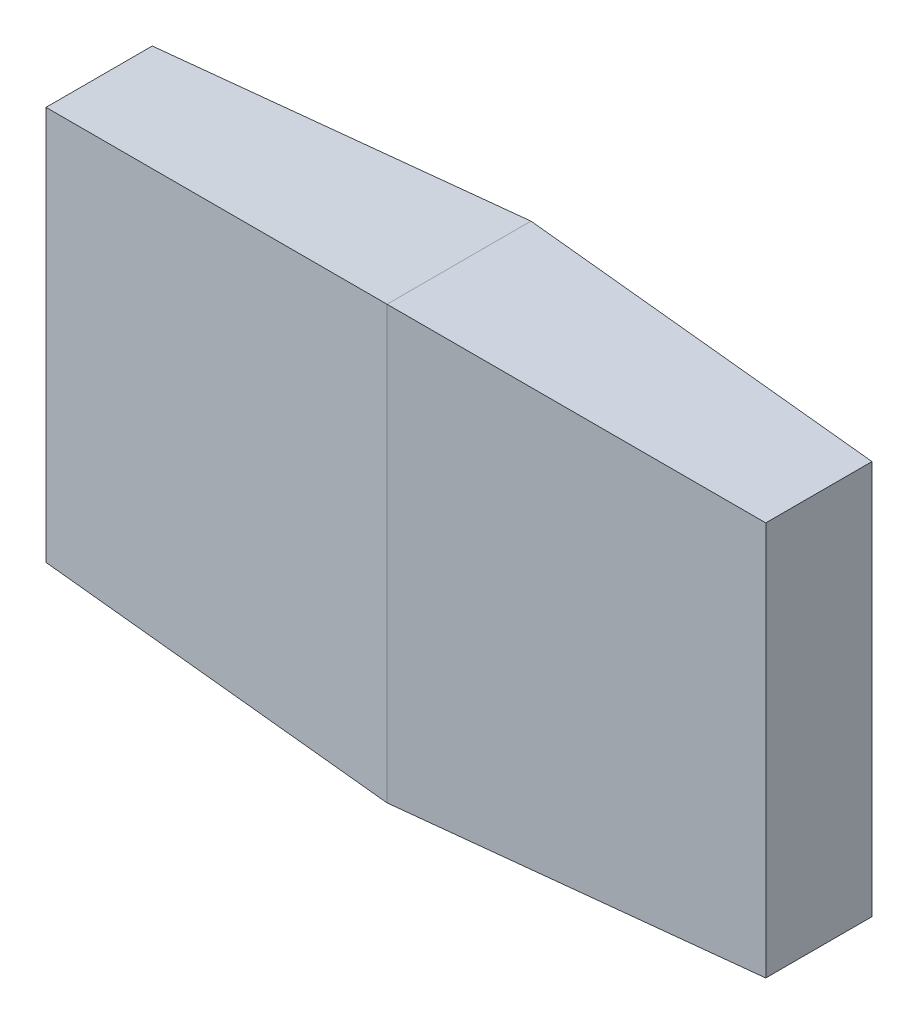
ISO-10303-21;
HEADER;
FILE_DESCRIPTION(('STEP AP214'),'2;1');
FILE_NAME('part.step','',(''),(''),'','','');
FILE_SCHEMA(('AUTOMOTIVE_DESIGN { 1 0 10303 214 1 1 1 1 }'));
ENDSEC;
DATA;
#1=APPLICATION_CONTEXT('core data for automotive mechanical design processes');
#2=APPLICATION_PROTOCOL_DEFINITION('international standard','automotive_design',2000,#1);
#3=PRODUCT_CONTEXT('',#1,'mechanical');
#4=PRODUCT('Part','Part','',(#3));
#5=PRODUCT_RELATED_PRODUCT_CATEGORY('part','',(#4));
#6=PRODUCT_DEFINITION_FORMATION('','',#4);
#7=PRODUCT_DEFINITION_CONTEXT('part definition',#1,'design');
#8=PRODUCT_DEFINITION('design','',#6,#7);
#9=PRODUCT_DEFINITION_SHAPE('','',#8);
#10=(LENGTH_UNIT() NAMED_UNIT(*) SI_UNIT(.MILLI.,.METRE.));
#11=(NAMED_UNIT(*) PLANE_ANGLE_UNIT() SI_UNIT($,.RADIAN.));
#12=(NAMED_UNIT(*) SI_UNIT($,.STERADIAN.) SOLID_ANGLE_UNIT());
#13=UNCERTAINTY_MEASURE_WITH_UNIT(LENGTH_MEASURE(1.E-05),#10,'distance_accuracy_value','');
#14=(GEOMETRIC_REPRESENTATION_CONTEXT(3) GLOBAL_UNCERTAINTY_ASSIGNED_CONTEXT((#13)) GLOBAL_UNIT_ASSIGNED_CONTEXT((#10,
#11,#12)) REPRESENTATION_CONTEXT('',''));
#15=CARTESIAN_POINT('',(0.,0.,0.));
#16=DIRECTION('',(0.,0.,1.));
#17=DIRECTION('',(1.,0.,0.));
#18=AXIS2_PLACEMENT_3D('',#15,#16,#17);
#19=CARTESIAN_POINT('',(0.,30.,0.));
#20=DIRECTION('',(-0.0523359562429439,0.998629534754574,0.));
#21=DIRECTION('',(-0.998629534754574,-0.0523359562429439,0.));
#22=AXIS2_PLACEMENT_3D('',#19,#20,#21);
#23=PLANE('',#22);
#24=DIRECTION('',(0.,0.,1.));
#25=VECTOR('',#24,1.);
#26=CARTESIAN_POINT('',(0.,30.,0.));
#27=LINE('',#26,#25);
#28=CARTESIAN_POINT('',(0.,30.,-10.));
#29=VERTEX_POINT('',#28);
#30=CARTESIAN_POINT('',(0.,30.,10.));
#31=VERTEX_POINT('',#30);
#32=EDGE_CURVE('E11',#29,#31,#27,.T.);
#33=ORIENTED_EDGE('',*,*,#32,.F.);
#34=DIRECTION('',(-0.997264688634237,-0.052264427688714,0.052264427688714));
#35=VECTOR('',#34,1.);
#36=CARTESIAN_POINT('',(-0.52121468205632,29.9726842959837,-9.97268429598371));
#37=LINE('',#36,#35);
#38=CARTESIAN_POINT('',(-50.,27.3796110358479,-7.37961103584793));
#39=VERTEX_POINT('',#38);
#40=EDGE_CURVE('E75',#29,#39,#37,.T.);
#41=ORIENTED_EDGE('',*,*,#40,.T.);
#42=DIRECTION('',(0.,0.,1.));
#43=VECTOR('',#42,1.);
#44=CARTESIAN_POINT('',(-50.,27.3796110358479,10.));
#45=LINE('',#44,#43);
#46=CARTESIAN_POINT('',(-50.,27.3796110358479,7.37961103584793));
#47=VERTEX_POINT('',#46);
#48=EDGE_CURVE('E111',#47,#39,#45,.F.);
#49=ORIENTED_EDGE('',*,*,#48,.F.);
#50=DIRECTION('',(0.997264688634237,0.052264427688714,0.052264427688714));
#51=VECTOR('',#50,1.);
#52=CARTESIAN_POINT('',(-0.52121468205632,29.9726842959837,9.97268429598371));
#53=LINE('',#52,#51);
#54=EDGE_CURVE('E102',#31,#47,#53,.F.);
#55=ORIENTED_EDGE('',*,*,#54,.F.);
#56=EDGE_LOOP('',(#33,#41,#49,#55));
#57=FACE_BOUND('',#56,.T.);
#58=ADVANCED_FACE('F35',(#57),#23,.T.);
#59=CARTESIAN_POINT('',(0.,0.,-10.));
#60=DIRECTION('',(-0.0523359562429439,0.,-0.998629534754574));
#61=DIRECTION('',(-0.998629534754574,0.,0.0523359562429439));
#62=AXIS2_PLACEMENT_3D('',#59,#60,#61);
#63=PLANE('',#62);
#64=DIRECTION('',(0.,1.,0.));
#65=VECTOR('',#64,1.);
#66=CARTESIAN_POINT('',(0.,0.,-10.));
#67=LINE('',#66,#65);
#68=CARTESIAN_POINT('',(0.,-30.,-10.));
#69=VERTEX_POINT('',#68);
#70=EDGE_CURVE('E46',#69,#29,#67,.T.);
#71=ORIENTED_EDGE('',*,*,#70,.F.);
#72=DIRECTION('',(0.997264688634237,-0.052264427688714,-0.052264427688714));
#73=VECTOR('',#72,1.);
#74=CARTESIAN_POINT('',(-0.52121468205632,-29.9726842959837,-9.97268429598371));
#75=LINE('',#74,#73);
#76=CARTESIAN_POINT('',(-50.,-27.3796110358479,-7.37961103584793));
#77=VERTEX_POINT('',#76);
#78=EDGE_CURVE('E125',#77,#69,#75,.T.);
#79=ORIENTED_EDGE('',*,*,#78,.F.);
#80=DIRECTION('',(0.,1.,0.));
#81=VECTOR('',#80,1.);
#82=CARTESIAN_POINT('',(-50.,30.,-7.37961103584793));
#83=LINE('',#82,#81);
#84=EDGE_CURVE('E39',#39,#77,#83,.F.);
#85=ORIENTED_EDGE('',*,*,#84,.F.);
#86=ORIENTED_EDGE('',*,*,#40,.F.);
#87=EDGE_LOOP('',(#71,#79,#85,#86));
#88=FACE_BOUND('',#87,.T.);
#89=ADVANCED_FACE('F37',(#88),#63,.T.);
#90=CARTESIAN_POINT('',(0.,-30.,0.));
#91=DIRECTION('',(-0.0523359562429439,-0.998629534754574,0.));
#92=DIRECTION('',(0.998629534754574,-0.0523359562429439,0.));
#93=AXIS2_PLACEMENT_3D('',#90,#91,#92);
#94=PLANE('',#93);
#95=DIRECTION('',(0.,0.,-1.));
#96=VECTOR('',#95,1.);
#97=CARTESIAN_POINT('',(0.,-30.,0.));
#98=LINE('',#97,#96);
#99=CARTESIAN_POINT('',(0.,-30.,10.));
#100=VERTEX_POINT('',#99);
#101=EDGE_CURVE('E130',#100,#69,#98,.T.);
#102=ORIENTED_EDGE('',*,*,#101,.F.);
#103=DIRECTION('',(-0.997264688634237,0.052264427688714,-0.052264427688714));
#104=VECTOR('',#103,1.);
#105=CARTESIAN_POINT('',(-0.52121468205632,-29.9726842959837,9.97268429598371));
#106=LINE('',#105,#104);
#107=CARTESIAN_POINT('',(-50.,-27.3796110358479,7.37961103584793));
#108=VERTEX_POINT('',#107);
#109=EDGE_CURVE('E103',#108,#100,#106,.F.);
#110=ORIENTED_EDGE('',*,*,#109,.F.);
#111=DIRECTION('',(0.,0.,1.));
#112=VECTOR('',#111,1.);
#113=CARTESIAN_POINT('',(-50.,-27.3796110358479,0.));
#114=LINE('',#113,#112);
#115=EDGE_CURVE('E139',#108,#77,#114,.F.);
#116=ORIENTED_EDGE('',*,*,#115,.T.);
#117=ORIENTED_EDGE('',*,*,#78,.T.);
#118=EDGE_LOOP('',(#102,#110,#116,#117));
#119=FACE_BOUND('',#118,.T.);
#120=ADVANCED_FACE('F160',(#119),#94,.T.);
#121=CARTESIAN_POINT('',(0.,0.,10.));
#122=DIRECTION('',(-0.0523359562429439,0.,0.998629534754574));
#123=DIRECTION('',(0.998629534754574,0.,0.0523359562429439));
#124=AXIS2_PLACEMENT_3D('',#121,#122,#123);
#125=PLANE('',#124);
#126=ORIENTED_EDGE('',*,*,#109,.T.);
#127=DIRECTION('',(0.,1.,0.));
#128=VECTOR('',#127,1.);
#129=CARTESIAN_POINT('',(0.,0.,10.));
#130=LINE('',#129,#128);
#131=EDGE_CURVE('E134',#100,#31,#130,.T.);
#132=ORIENTED_EDGE('',*,*,#131,.T.);
#133=ORIENTED_EDGE('',*,*,#54,.T.);
#134=DIRECTION('',(0.,-1.,0.));
#135=VECTOR('',#134,1.);
#136=CARTESIAN_POINT('',(-50.,30.,7.37961103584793));
#137=LINE('',#136,#135);
#138=EDGE_CURVE('E122',#47,#108,#137,.T.);
#139=ORIENTED_EDGE('',*,*,#138,.T.);
#140=EDGE_LOOP('',(#126,#132,#133,#139));
#141=FACE_BOUND('',#140,.T.);
#142=ADVANCED_FACE('F158',(#141),#125,.T.);
#143=CARTESIAN_POINT('',(-50.,30.,10.));
#144=DIRECTION('',(1.,0.,0.));
#145=DIRECTION('',(0.,1.,0.));
#146=AXIS2_PLACEMENT_3D('',#143,#144,#145);
#147=PLANE('',#146);
#148=ORIENTED_EDGE('',*,*,#84,.T.);
#149=ORIENTED_EDGE('',*,*,#115,.F.);
#150=ORIENTED_EDGE('',*,*,#138,.F.);
#151=ORIENTED_EDGE('',*,*,#48,.T.);
#152=EDGE_LOOP('',(#148,#149,#150,#151));
#153=FACE_BOUND('',#152,.T.);
#154=ADVANCED_FACE('F161',(#153),#147,.F.);
#155=CARTESIAN_POINT('',(0.,-30.,0.));
#156=DIRECTION('',(0.0523359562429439,-0.998629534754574,0.));
#157=DIRECTION('',(0.998629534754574,0.0523359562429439,0.));
#158=AXIS2_PLACEMENT_3D('',#155,#156,#157);
#159=PLANE('',#158);
#160=DIRECTION('',(-0.997264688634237,-0.052264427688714,0.052264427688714));
#161=VECTOR('',#160,1.);
#162=CARTESIAN_POINT('',(0.52121468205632,-29.9726842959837,9.97268429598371));
#163=LINE('',#162,#161);
#164=CARTESIAN_POINT('',(50.,-27.3796110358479,7.37961103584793));
#165=VERTEX_POINT('',#164);
#166=EDGE_CURVE('E100',#100,#165,#163,.F.);
#167=ORIENTED_EDGE('',*,*,#166,.F.);
#168=ORIENTED_EDGE('',*,*,#101,.T.);
#169=DIRECTION('',(0.997264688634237,0.052264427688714,0.052264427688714));
#170=VECTOR('',#169,1.);
#171=CARTESIAN_POINT('',(0.52121468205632,-29.9726842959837,-9.97268429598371));
#172=LINE('',#171,#170);
#173=CARTESIAN_POINT('',(50.,-27.3796110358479,-7.37961103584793));
#174=VERTEX_POINT('',#173);
#175=EDGE_CURVE('E127',#69,#174,#172,.T.);
#176=ORIENTED_EDGE('',*,*,#175,.T.);
#177=DIRECTION('',(0.,0.,1.));
#178=VECTOR('',#177,1.);
#179=CARTESIAN_POINT('',(50.,-27.3796110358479,10.));
#180=LINE('',#179,#178);
#181=EDGE_CURVE('E110',#165,#174,#180,.F.);
#182=ORIENTED_EDGE('',*,*,#181,.F.);
#183=EDGE_LOOP('',(#167,#168,#176,#182));
#184=FACE_BOUND('',#183,.T.);
#185=ADVANCED_FACE('F157',(#184),#159,.T.);
#186=CARTESIAN_POINT('',(50.,30.,10.));
#187=DIRECTION('',(-1.,0.,0.));
#188=DIRECTION('',(0.,-1.,0.));
#189=AXIS2_PLACEMENT_3D('',#186,#187,#188);
#190=PLANE('',#189);
#191=DIRECTION('',(0.,-1.,0.));
#192=VECTOR('',#191,1.);
#193=CARTESIAN_POINT('',(50.,30.,-7.37961103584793));
#194=LINE('',#193,#192);
#195=CARTESIAN_POINT('',(50.,27.3796110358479,-7.37961103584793));
#196=VERTEX_POINT('',#195);
#197=EDGE_CURVE('E83',#174,#196,#194,.F.);
#198=ORIENTED_EDGE('',*,*,#197,.T.);
#199=DIRECTION('',(0.,0.,1.));
#200=VECTOR('',#199,1.);
#201=CARTESIAN_POINT('',(50.,27.3796110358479,0.));
#202=LINE('',#201,#200);
#203=CARTESIAN_POINT('',(50.,27.3796110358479,7.37961103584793));
#204=VERTEX_POINT('',#203);
#205=EDGE_CURVE('E105',#204,#196,#202,.F.);
#206=ORIENTED_EDGE('',*,*,#205,.F.);
#207=DIRECTION('',(0.,1.,0.));
#208=VECTOR('',#207,1.);
#209=CARTESIAN_POINT('',(50.,30.,7.37961103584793));
#210=LINE('',#209,#208);
#211=EDGE_CURVE('E94',#165,#204,#210,.T.);
#212=ORIENTED_EDGE('',*,*,#211,.F.);
#213=ORIENTED_EDGE('',*,*,#181,.T.);
#214=EDGE_LOOP('',(#198,#206,#212,#213));
#215=FACE_BOUND('',#214,.T.);
#216=ADVANCED_FACE('F106',(#215),#190,.F.);
#217=CARTESIAN_POINT('',(0.,30.,0.));
#218=DIRECTION('',(0.0523359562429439,0.998629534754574,0.));
#219=DIRECTION('',(-0.998629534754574,0.0523359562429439,0.));
#220=AXIS2_PLACEMENT_3D('',#217,#218,#219);
#221=PLANE('',#220);
#222=DIRECTION('',(-0.997264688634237,0.052264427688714,-0.052264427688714));
#223=VECTOR('',#222,1.);
#224=CARTESIAN_POINT('',(0.52121468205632,29.9726842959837,-9.97268429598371));
#225=LINE('',#224,#223);
#226=EDGE_CURVE('E119',#196,#29,#225,.T.);
#227=ORIENTED_EDGE('',*,*,#226,.T.);
#228=ORIENTED_EDGE('',*,*,#32,.T.);
#229=DIRECTION('',(0.997264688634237,-0.052264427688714,-0.052264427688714));
#230=VECTOR('',#229,1.);
#231=CARTESIAN_POINT('',(0.52121468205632,29.9726842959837,9.97268429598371));
#232=LINE('',#231,#230);
#233=EDGE_CURVE('E98',#204,#31,#232,.F.);
#234=ORIENTED_EDGE('',*,*,#233,.F.);
#235=ORIENTED_EDGE('',*,*,#205,.T.);
#236=EDGE_LOOP('',(#227,#228,#234,#235));
#237=FACE_BOUND('',#236,.T.);
#238=ADVANCED_FACE('F113',(#237),#221,.T.);
#239=CARTESIAN_POINT('',(0.,0.,10.));
#240=DIRECTION('',(0.0523359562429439,0.,0.998629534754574));
#241=DIRECTION('',(0.998629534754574,0.,-0.0523359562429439));
#242=AXIS2_PLACEMENT_3D('',#239,#240,#241);
#243=PLANE('',#242);
#244=ORIENTED_EDGE('',*,*,#131,.F.);
#245=ORIENTED_EDGE('',*,*,#166,.T.);
#246=ORIENTED_EDGE('',*,*,#211,.T.);
#247=ORIENTED_EDGE('',*,*,#233,.T.);
#248=EDGE_LOOP('',(#244,#245,#246,#247));
#249=FACE_BOUND('',#248,.T.);
#250=ADVANCED_FACE('F96',(#249),#243,.T.);
#251=CARTESIAN_POINT('',(0.,0.,-10.));
#252=DIRECTION('',(0.0523359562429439,0.,-0.998629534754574));
#253=DIRECTION('',(-0.998629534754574,0.,-0.0523359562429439));
#254=AXIS2_PLACEMENT_3D('',#251,#252,#253);
#255=PLANE('',#254);
#256=ORIENTED_EDGE('',*,*,#175,.F.);
#257=ORIENTED_EDGE('',*,*,#70,.T.);
#258=ORIENTED_EDGE('',*,*,#226,.F.);
#259=ORIENTED_EDGE('',*,*,#197,.F.);
#260=EDGE_LOOP('',(#256,#257,#258,#259));
#261=FACE_BOUND('',#260,.T.);
#262=ADVANCED_FACE('F148',(#261),#255,.T.);
#263=CLOSED_SHELL('',(#58,#89,#120,#142,#154,#185,#216,#238,#250,#262));
#264=MANIFOLD_SOLID_BREP('B2',#263);
#265=ADVANCED_BREP_SHAPE_REPRESENTATION('',(#18,#264),#14);
#266=SHAPE_DEFINITION_REPRESENTATION(#9,#265);
ENDSEC;
END-ISO-10303-21;
